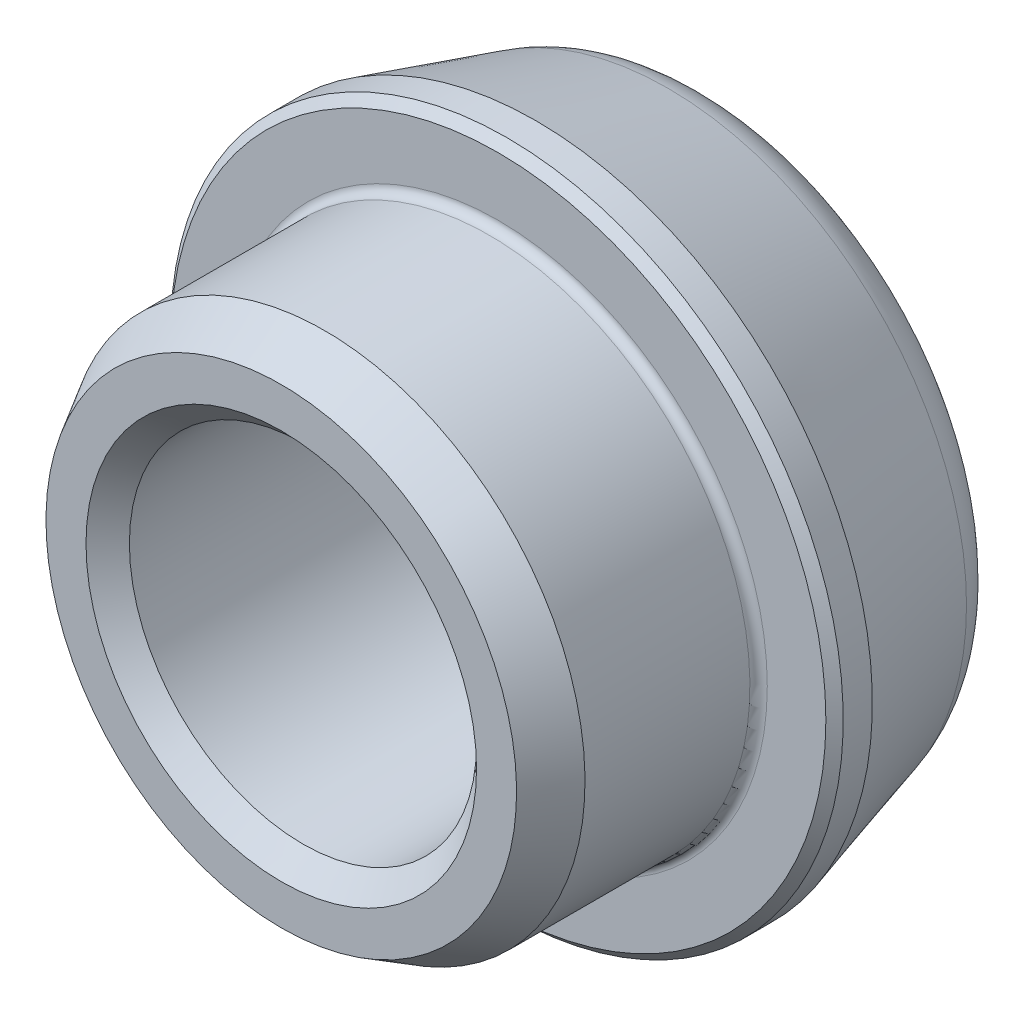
ISO-10303-21;
HEADER;
FILE_DESCRIPTION(('STEP AP214'),'2;1');
FILE_NAME('part.step','',(''),(''),'','','');
FILE_SCHEMA(('AUTOMOTIVE_DESIGN { 1 0 10303 214 1 1 1 1 }'));
ENDSEC;
DATA;
#1=APPLICATION_CONTEXT('core data for automotive mechanical design processes');
#2=APPLICATION_PROTOCOL_DEFINITION('international standard','automotive_design',2000,#1);
#3=PRODUCT_CONTEXT('',#1,'mechanical');
#4=PRODUCT('Part','Part','',(#3));
#5=PRODUCT_RELATED_PRODUCT_CATEGORY('part','',(#4));
#6=PRODUCT_DEFINITION_FORMATION('','',#4);
#7=PRODUCT_DEFINITION_CONTEXT('part definition',#1,'design');
#8=PRODUCT_DEFINITION('design','',#6,#7);
#9=PRODUCT_DEFINITION_SHAPE('','',#8);
#10=(LENGTH_UNIT() NAMED_UNIT(*) SI_UNIT(.MILLI.,.METRE.));
#11=(NAMED_UNIT(*) PLANE_ANGLE_UNIT() SI_UNIT($,.RADIAN.));
#12=(NAMED_UNIT(*) SI_UNIT($,.STERADIAN.) SOLID_ANGLE_UNIT());
#13=UNCERTAINTY_MEASURE_WITH_UNIT(LENGTH_MEASURE(1.E-05),#10,'distance_accuracy_value','');
#14=(GEOMETRIC_REPRESENTATION_CONTEXT(3) GLOBAL_UNCERTAINTY_ASSIGNED_CONTEXT((#13)) GLOBAL_UNIT_ASSIGNED_CONTEXT((#10,
#11,#12)) REPRESENTATION_CONTEXT('',''));
#15=CARTESIAN_POINT('',(0.,0.,0.));
#16=DIRECTION('',(0.,0.,1.));
#17=DIRECTION('',(1.,0.,0.));
#18=AXIS2_PLACEMENT_3D('',#15,#16,#17);
#19=CARTESIAN_POINT('',(0.,0.,0.));
#20=DIRECTION('',(0.,0.,-1.));
#21=DIRECTION('',(0.,1.,0.));
#22=AXIS2_PLACEMENT_3D('',#19,#20,#21);
#23=CYLINDRICAL_SURFACE('',#22,6.);
#24=CARTESIAN_POINT('',(0.,0.,0.2));
#25=DIRECTION('',(0.,0.,1.));
#26=DIRECTION('',(0.,-1.,0.));
#27=AXIS2_PLACEMENT_3D('',#24,#25,#26);
#28=CIRCLE('',#27,6.);
#29=CARTESIAN_POINT('',(0.,-6.,0.2));
#30=VERTEX_POINT('',#29);
#31=EDGE_CURVE('E32',#30,#30,#28,.T.);
#32=ORIENTED_EDGE('',*,*,#31,.T.);
#33=EDGE_LOOP('',(#32));
#34=FACE_BOUND('',#33,.T.);
#35=CARTESIAN_POINT('',(0.,0.,4.));
#36=DIRECTION('',(0.,0.,1.));
#37=DIRECTION('',(0.,-1.,0.));
#38=AXIS2_PLACEMENT_3D('',#35,#36,#37);
#39=CIRCLE('',#38,6.);
#40=CARTESIAN_POINT('',(0.,-6.,4.));
#41=VERTEX_POINT('',#40);
#42=EDGE_CURVE('E47',#41,#41,#39,.F.);
#43=ORIENTED_EDGE('',*,*,#42,.T.);
#44=EDGE_LOOP('',(#43));
#45=FACE_BOUND('',#44,.T.);
#46=ADVANCED_FACE('F12',(#34,#45),#23,.T.);
#47=CARTESIAN_POINT('',(6.,0.,0.));
#48=DIRECTION('',(0.,0.,1.));
#49=DIRECTION('',(0.,-1.,0.));
#50=AXIS2_PLACEMENT_3D('',#47,#48,#49);
#51=PLANE('',#50);
#52=CARTESIAN_POINT('',(0.,0.,0.));
#53=DIRECTION('',(0.,0.,1.));
#54=DIRECTION('',(0.,-1.,0.));
#55=AXIS2_PLACEMENT_3D('',#52,#53,#54);
#56=CIRCLE('',#55,6.2);
#57=CARTESIAN_POINT('',(0.,-6.2,0.));
#58=VERTEX_POINT('',#57);
#59=EDGE_CURVE('E35',#58,#58,#56,.F.);
#60=ORIENTED_EDGE('',*,*,#59,.T.);
#61=EDGE_LOOP('',(#60));
#62=FACE_BOUND('',#61,.T.);
#63=CARTESIAN_POINT('',(0.,0.,0.));
#64=DIRECTION('',(0.,0.,1.));
#65=DIRECTION('',(0.,-1.,0.));
#66=AXIS2_PLACEMENT_3D('',#63,#64,#65);
#67=CIRCLE('',#66,7.55);
#68=CARTESIAN_POINT('',(0.,-7.55,0.));
#69=VERTEX_POINT('',#68);
#70=EDGE_CURVE('E38',#69,#69,#67,.T.);
#71=ORIENTED_EDGE('',*,*,#70,.T.);
#72=EDGE_LOOP('',(#71));
#73=FACE_BOUND('',#72,.T.);
#74=ADVANCED_FACE('F64',(#62,#73),#51,.T.);
#75=CARTESIAN_POINT('',(0.,0.,0.));
#76=DIRECTION('',(0.,0.,-1.));
#77=DIRECTION('',(0.,1.,0.));
#78=AXIS2_PLACEMENT_3D('',#75,#76,#77);
#79=CYLINDRICAL_SURFACE('',#78,7.75);
#80=CARTESIAN_POINT('',(0.,0.,-0.2));
#81=DIRECTION('',(0.,0.,1.));
#82=DIRECTION('',(0.,-1.,0.));
#83=AXIS2_PLACEMENT_3D('',#80,#81,#82);
#84=CIRCLE('',#83,7.75);
#85=CARTESIAN_POINT('',(0.,-7.75,-0.2));
#86=VERTEX_POINT('',#85);
#87=EDGE_CURVE('E41',#86,#86,#84,.F.);
#88=ORIENTED_EDGE('',*,*,#87,.T.);
#89=EDGE_LOOP('',(#88));
#90=FACE_BOUND('',#89,.T.);
#91=CARTESIAN_POINT('',(0.,0.,-0.871853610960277));
#92=DIRECTION('',(0.,0.,-1.));
#93=DIRECTION('',(0.,1.,0.));
#94=AXIS2_PLACEMENT_3D('',#91,#92,#93);
#95=CIRCLE('',#94,7.75);
#96=CARTESIAN_POINT('',(0.,7.75,-0.871853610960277));
#97=VERTEX_POINT('',#96);
#98=EDGE_CURVE('E56',#97,#97,#95,.T.);
#99=ORIENTED_EDGE('',*,*,#98,.F.);
#100=EDGE_LOOP('',(#99));
#101=FACE_BOUND('',#100,.T.);
#102=ADVANCED_FACE('F62',(#90,#101),#79,.T.);
#103=CARTESIAN_POINT('',(0.,0.,-5.));
#104=DIRECTION('',(0.,0.,1.));
#105=DIRECTION('',(0.,-1.,0.));
#106=AXIS2_PLACEMENT_3D('',#103,#104,#105);
#107=CONICAL_SURFACE('',#106,6.56627307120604,0.279252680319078);
#108=CARTESIAN_POINT('',(0.,0.,-3.91345603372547));
#109=DIRECTION('',(0.,0.,-1.));
#110=DIRECTION('',(0.,1.,0.));
#111=AXIS2_PLACEMENT_3D('',#108,#109,#110);
#112=CIRCLE('',#111,6.87783453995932);
#113=CARTESIAN_POINT('',(0.,6.87783453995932,-3.91345603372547));
#114=VERTEX_POINT('',#113);
#115=EDGE_CURVE('E50',#114,#114,#112,.F.);
#116=ORIENTED_EDGE('',*,*,#115,.T.);
#117=EDGE_LOOP('',(#116));
#118=FACE_BOUND('',#117,.T.);
#119=ORIENTED_EDGE('',*,*,#98,.T.);
#120=EDGE_LOOP('',(#119));
#121=FACE_BOUND('',#120,.T.);
#122=ADVANCED_FACE('F60',(#118,#121),#107,.T.);
#123=CARTESIAN_POINT('',(0.,0.,-5.));
#124=DIRECTION('',(0.,0.,-1.));
#125=DIRECTION('',(0.,1.,0.));
#126=AXIS2_PLACEMENT_3D('',#123,#124,#125);
#127=PLANE('',#126);
#128=CARTESIAN_POINT('',(0.,0.,-5.));
#129=DIRECTION('',(0.,0.,-1.));
#130=DIRECTION('',(-1.,0.,0.));
#131=AXIS2_PLACEMENT_3D('',#128,#129,#130);
#132=CIRCLE('',#131,4.5);
#133=CARTESIAN_POINT('',(-4.5,0.,-5.));
#134=VERTEX_POINT('',#133);
#135=EDGE_CURVE('E19',#134,#134,#132,.F.);
#136=ORIENTED_EDGE('',*,*,#135,.T.);
#137=EDGE_LOOP('',(#136));
#138=FACE_BOUND('',#137,.T.);
#139=CARTESIAN_POINT('',(0.,0.,-5.));
#140=DIRECTION('',(0.,0.,-1.));
#141=DIRECTION('',(0.,1.,0.));
#142=AXIS2_PLACEMENT_3D('',#139,#140,#141);
#143=CIRCLE('',#142,5.43594199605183);
#144=CARTESIAN_POINT('',(0.,5.43594199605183,-5.));
#145=VERTEX_POINT('',#144);
#146=EDGE_CURVE('E53',#145,#145,#143,.T.);
#147=ORIENTED_EDGE('',*,*,#146,.T.);
#148=EDGE_LOOP('',(#147));
#149=FACE_BOUND('',#148,.T.);
#150=ADVANCED_FACE('F72',(#138,#149),#127,.T.);
#151=CARTESIAN_POINT('',(0.,0.,5.));
#152=DIRECTION('',(0.,0.,1.));
#153=DIRECTION('',(0.,-1.,0.));
#154=AXIS2_PLACEMENT_3D('',#151,#152,#153);
#155=PLANE('',#154);
#156=CARTESIAN_POINT('',(0.,0.,5.));
#157=DIRECTION('',(0.,0.,1.));
#158=DIRECTION('',(1.,0.,0.));
#159=AXIS2_PLACEMENT_3D('',#156,#157,#158);
#160=CIRCLE('',#159,4.5);
#161=CARTESIAN_POINT('',(4.5,0.,5.));
#162=VERTEX_POINT('',#161);
#163=EDGE_CURVE('E8',#162,#162,#160,.F.);
#164=ORIENTED_EDGE('',*,*,#163,.T.);
#165=EDGE_LOOP('',(#164));
#166=FACE_BOUND('',#165,.T.);
#167=CARTESIAN_POINT('',(0.,0.,5.));
#168=DIRECTION('',(0.,0.,1.));
#169=DIRECTION('',(0.,-1.,0.));
#170=AXIS2_PLACEMENT_3D('',#167,#168,#169);
#171=CIRCLE('',#170,5.42264973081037);
#172=CARTESIAN_POINT('',(0.,-5.42264973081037,5.));
#173=VERTEX_POINT('',#172);
#174=EDGE_CURVE('E44',#173,#173,#171,.T.);
#175=ORIENTED_EDGE('',*,*,#174,.T.);
#176=EDGE_LOOP('',(#175));
#177=FACE_BOUND('',#176,.T.);
#178=ADVANCED_FACE('F88',(#166,#177),#155,.T.);
#179=CARTESIAN_POINT('',(0.,0.,-3.5));
#180=DIRECTION('',(0.,0.,-1.));
#181=DIRECTION('',(0.,1.,0.));
#182=AXIS2_PLACEMENT_3D('',#179,#180,#181);
#183=TOROIDAL_SURFACE('',#182,5.43594199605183,1.5);
#184=ORIENTED_EDGE('',*,*,#115,.F.);
#185=EDGE_LOOP('',(#184));
#186=FACE_BOUND('',#185,.T.);
#187=ORIENTED_EDGE('',*,*,#146,.F.);
#188=EDGE_LOOP('',(#187));
#189=FACE_BOUND('',#188,.T.);
#190=ADVANCED_FACE('F84',(#186,#189),#183,.T.);
#191=CARTESIAN_POINT('',(0.,0.,4.));
#192=DIRECTION('',(0.,0.,-1.));
#193=DIRECTION('',(0.,1.,0.));
#194=AXIS2_PLACEMENT_3D('',#191,#192,#193);
#195=CONICAL_SURFACE('',#194,6.,0.523598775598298);
#196=ORIENTED_EDGE('',*,*,#174,.F.);
#197=EDGE_LOOP('',(#196));
#198=FACE_BOUND('',#197,.T.);
#199=ORIENTED_EDGE('',*,*,#42,.F.);
#200=EDGE_LOOP('',(#199));
#201=FACE_BOUND('',#200,.T.);
#202=ADVANCED_FACE('F87',(#198,#201),#195,.T.);
#203=CARTESIAN_POINT('',(0.,0.,-0.2));
#204=DIRECTION('',(0.,0.,-1.));
#205=DIRECTION('',(0.,1.,0.));
#206=AXIS2_PLACEMENT_3D('',#203,#204,#205);
#207=CONICAL_SURFACE('',#206,7.75,0.78539816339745);
#208=ORIENTED_EDGE('',*,*,#70,.F.);
#209=EDGE_LOOP('',(#208));
#210=FACE_BOUND('',#209,.T.);
#211=ORIENTED_EDGE('',*,*,#87,.F.);
#212=EDGE_LOOP('',(#211));
#213=FACE_BOUND('',#212,.T.);
#214=ADVANCED_FACE('F92',(#210,#213),#207,.T.);
#215=CARTESIAN_POINT('',(0.,0.,0.2));
#216=DIRECTION('',(0.,0.,1.));
#217=DIRECTION('',(0.,-1.,0.));
#218=AXIS2_PLACEMENT_3D('',#215,#216,#217);
#219=TOROIDAL_SURFACE('',#218,6.2,0.2);
#220=ORIENTED_EDGE('',*,*,#31,.F.);
#221=EDGE_LOOP('',(#220));
#222=FACE_BOUND('',#221,.T.);
#223=ORIENTED_EDGE('',*,*,#59,.F.);
#224=EDGE_LOOP('',(#223));
#225=FACE_BOUND('',#224,.T.);
#226=ADVANCED_FACE('F96',(#222,#225),#219,.F.);
#227=CARTESIAN_POINT('',(0.,0.,5.));
#228=DIRECTION('',(0.,0.,-1.));
#229=DIRECTION('',(-1.,0.,0.));
#230=AXIS2_PLACEMENT_3D('',#227,#228,#229);
#231=CYLINDRICAL_SURFACE('',#230,4.);
#232=CARTESIAN_POINT('',(0.,0.,-4.5));
#233=DIRECTION('',(0.,0.,-1.));
#234=DIRECTION('',(-1.,0.,0.));
#235=AXIS2_PLACEMENT_3D('',#232,#233,#234);
#236=CIRCLE('',#235,4.);
#237=CARTESIAN_POINT('',(-4.,0.,-4.5));
#238=VERTEX_POINT('',#237);
#239=EDGE_CURVE('E23',#238,#238,#236,.T.);
#240=ORIENTED_EDGE('',*,*,#239,.T.);
#241=EDGE_LOOP('',(#240));
#242=FACE_BOUND('',#241,.T.);
#243=CARTESIAN_POINT('',(0.,0.,4.5));
#244=DIRECTION('',(0.,0.,1.));
#245=DIRECTION('',(1.,0.,0.));
#246=AXIS2_PLACEMENT_3D('',#243,#244,#245);
#247=CIRCLE('',#246,4.);
#248=CARTESIAN_POINT('',(4.,0.,4.5));
#249=VERTEX_POINT('',#248);
#250=EDGE_CURVE('E27',#249,#249,#247,.T.);
#251=ORIENTED_EDGE('',*,*,#250,.T.);
#252=EDGE_LOOP('',(#251));
#253=FACE_BOUND('',#252,.T.);
#254=ADVANCED_FACE('F99',(#242,#253),#231,.F.);
#255=CARTESIAN_POINT('',(0.,0.,-4.5));
#256=DIRECTION('',(0.,0.,-1.));
#257=DIRECTION('',(-1.,0.,0.));
#258=AXIS2_PLACEMENT_3D('',#255,#256,#257);
#259=CONICAL_SURFACE('',#258,4.,0.785398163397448);
#260=ORIENTED_EDGE('',*,*,#135,.F.);
#261=EDGE_LOOP('',(#260));
#262=FACE_BOUND('',#261,.T.);
#263=ORIENTED_EDGE('',*,*,#239,.F.);
#264=EDGE_LOOP('',(#263));
#265=FACE_BOUND('',#264,.T.);
#266=ADVANCED_FACE('F101',(#262,#265),#259,.F.);
#267=CARTESIAN_POINT('',(0.,0.,5.));
#268=DIRECTION('',(0.,0.,1.));
#269=DIRECTION('',(1.,0.,0.));
#270=AXIS2_PLACEMENT_3D('',#267,#268,#269);
#271=CONICAL_SURFACE('',#270,4.5,0.785398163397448);
#272=ORIENTED_EDGE('',*,*,#250,.F.);
#273=EDGE_LOOP('',(#272));
#274=FACE_BOUND('',#273,.T.);
#275=ORIENTED_EDGE('',*,*,#163,.F.);
#276=EDGE_LOOP('',(#275));
#277=FACE_BOUND('',#276,.T.);
#278=ADVANCED_FACE('F14',(#274,#277),#271,.F.);
#279=CLOSED_SHELL('',(#46,#74,#102,#122,#150,#178,#190,#202,#214,#226,#254,#266,#278));
#280=MANIFOLD_SOLID_BREP('B1',#279);
#281=ADVANCED_BREP_SHAPE_REPRESENTATION('',(#18,#280),#14);
#282=SHAPE_DEFINITION_REPRESENTATION(#9,#281);
ENDSEC;
END-ISO-10303-21;
